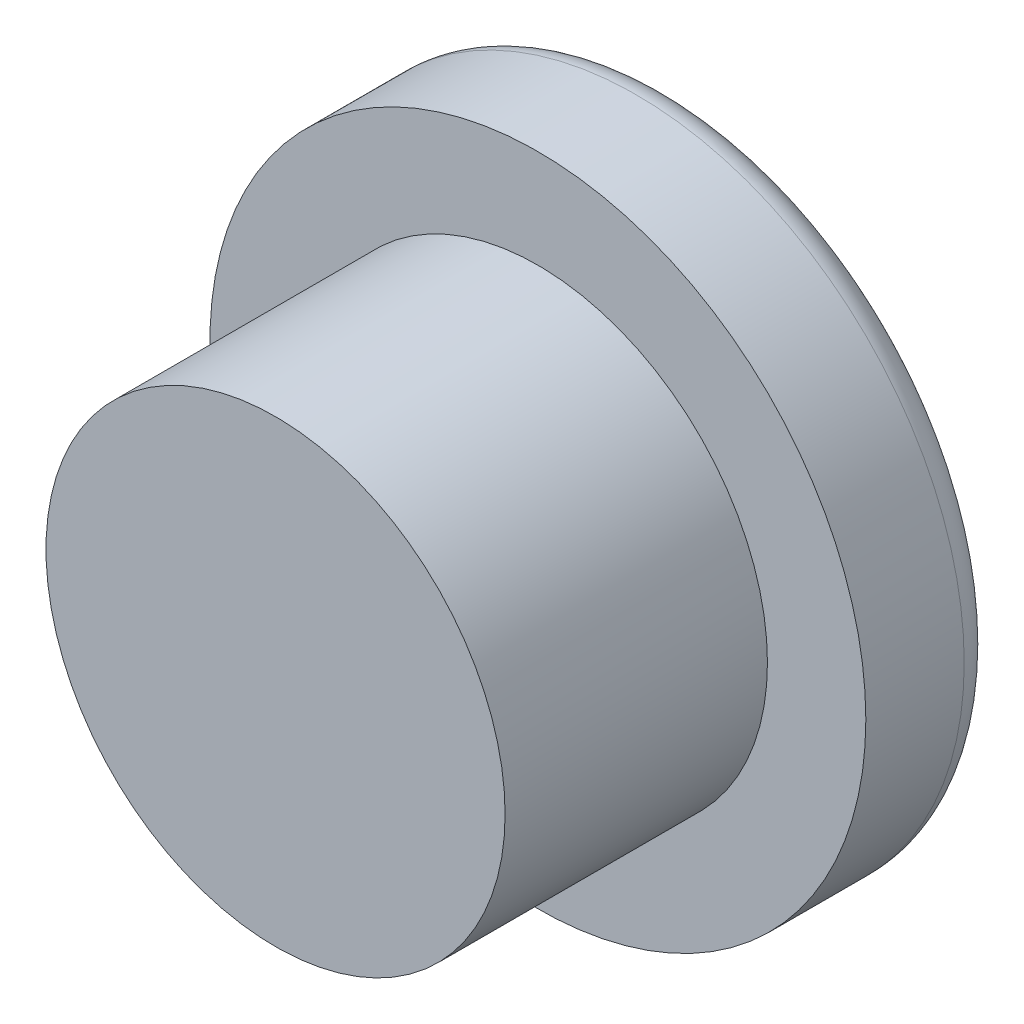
ISO-10303-21;
HEADER;
FILE_DESCRIPTION(('STEP AP214'),'2;1');
FILE_NAME('part.step','',(''),(''),'','','');
FILE_SCHEMA(('AUTOMOTIVE_DESIGN { 1 0 10303 214 1 1 1 1 }'));
ENDSEC;
DATA;
#1=APPLICATION_CONTEXT('core data for automotive mechanical design processes');
#2=APPLICATION_PROTOCOL_DEFINITION('international standard','automotive_design',2000,#1);
#3=PRODUCT_CONTEXT('',#1,'mechanical');
#4=PRODUCT('Part','Part','',(#3));
#5=PRODUCT_RELATED_PRODUCT_CATEGORY('part','',(#4));
#6=PRODUCT_DEFINITION_FORMATION('','',#4);
#7=PRODUCT_DEFINITION_CONTEXT('part definition',#1,'design');
#8=PRODUCT_DEFINITION('design','',#6,#7);
#9=PRODUCT_DEFINITION_SHAPE('','',#8);
#10=(LENGTH_UNIT() NAMED_UNIT(*) SI_UNIT(.MILLI.,.METRE.));
#11=(NAMED_UNIT(*) PLANE_ANGLE_UNIT() SI_UNIT($,.RADIAN.));
#12=(NAMED_UNIT(*) SI_UNIT($,.STERADIAN.) SOLID_ANGLE_UNIT());
#13=UNCERTAINTY_MEASURE_WITH_UNIT(LENGTH_MEASURE(1.E-05),#10,'distance_accuracy_value','');
#14=(GEOMETRIC_REPRESENTATION_CONTEXT(3) GLOBAL_UNCERTAINTY_ASSIGNED_CONTEXT((#13)) GLOBAL_UNIT_ASSIGNED_CONTEXT((#10,
#11,#12)) REPRESENTATION_CONTEXT('',''));
#15=CARTESIAN_POINT('',(0.,0.,0.));
#16=DIRECTION('',(0.,0.,1.));
#17=DIRECTION('',(1.,0.,0.));
#18=AXIS2_PLACEMENT_3D('',#15,#16,#17);
#19=CARTESIAN_POINT('',(0.,0.,0.2));
#20=DIRECTION('',(0.,0.,-1.));
#21=DIRECTION('',(-1.,0.,0.));
#22=AXIS2_PLACEMENT_3D('',#19,#20,#21);
#23=PLANE('',#22);
#24=DIRECTION('',(-0.327448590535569,-0.944868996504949,0.));
#25=VECTOR('',#24,1.);
#26=CARTESIAN_POINT('',(-1.08300194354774,1.94067828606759,0.2));
#27=LINE('',#26,#25);
#28=CARTESIAN_POINT('',(-1.08300194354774,1.94067828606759,0.2));
#29=VERTEX_POINT('',#28);
#30=CARTESIAN_POINT('',(-2.29594264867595,-1.55932171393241,0.2));
#31=VERTEX_POINT('',#30);
#32=EDGE_CURVE('E232',#29,#31,#27,.T.);
#33=ORIENTED_EDGE('',*,*,#32,.T.);
#34=DIRECTION('',(1.,0.,0.));
#35=VECTOR('',#34,1.);
#36=CARTESIAN_POINT('',(-2.29594264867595,-1.55932171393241,0.2));
#37=LINE('',#36,#35);
#38=CARTESIAN_POINT('',(-1.67404761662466,-1.55932171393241,0.2));
#39=VERTEX_POINT('',#38);
#40=EDGE_CURVE('E272',#31,#39,#37,.T.);
#41=ORIENTED_EDGE('',*,*,#40,.T.);
#42=DIRECTION('',(0.315486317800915,0.948930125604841,0.));
#43=VECTOR('',#42,1.);
#44=CARTESIAN_POINT('',(-1.67404761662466,-1.55932171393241,0.2));
#45=LINE('',#44,#43);
#46=CARTESIAN_POINT('',(-1.40551796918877,-0.751629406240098,0.2));
#47=VERTEX_POINT('',#46);
#48=EDGE_CURVE('E274',#39,#47,#45,.T.);
#49=ORIENTED_EDGE('',*,*,#48,.T.);
#50=DIRECTION('',(1.,0.,0.));
#51=VECTOR('',#50,1.);
#52=CARTESIAN_POINT('',(-1.40551796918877,-0.751629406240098,0.2));
#53=LINE('',#52,#51);
#54=CARTESIAN_POINT('',(-0.182060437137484,-0.751629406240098,0.2));
#55=VERTEX_POINT('',#54);
#56=EDGE_CURVE('E276',#47,#55,#53,.T.);
#57=ORIENTED_EDGE('',*,*,#56,.T.);
#58=DIRECTION('',(0.314001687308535,-0.949422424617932,0.));
#59=VECTOR('',#58,1.);
#60=CARTESIAN_POINT('',(-0.182060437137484,-0.751629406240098,0.2));
#61=LINE('',#60,#59);
#62=CARTESIAN_POINT('',(0.08506696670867,-1.55932171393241,0.2));
#63=VERTEX_POINT('',#62);
#64=EDGE_CURVE('E278',#55,#63,#61,.T.);
#65=ORIENTED_EDGE('',*,*,#64,.T.);
#66=DIRECTION('',(1.,0.,0.));
#67=VECTOR('',#66,1.);
#68=CARTESIAN_POINT('',(0.0850669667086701,-1.55932171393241,0.2));
#69=LINE('',#68,#67);
#70=CARTESIAN_POINT('',(0.710467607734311,-1.55932171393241,0.2));
#71=VERTEX_POINT('',#70);
#72=EDGE_CURVE('E280',#63,#71,#69,.T.);
#73=ORIENTED_EDGE('',*,*,#72,.T.);
#74=DIRECTION('',(-0.326095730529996,0.94533675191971,0.));
#75=VECTOR('',#74,1.);
#76=CARTESIAN_POINT('',(0.710467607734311,-1.55932171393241,0.2));
#77=LINE('',#76,#75);
#78=CARTESIAN_POINT('',(-0.496864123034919,1.94067828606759,0.2));
#79=VERTEX_POINT('',#78);
#80=EDGE_CURVE('E54',#71,#79,#77,.T.);
#81=ORIENTED_EDGE('',*,*,#80,.T.);
#82=DIRECTION('',(-1.,0.,0.));
#83=VECTOR('',#82,1.);
#84=CARTESIAN_POINT('',(-0.49686412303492,1.94067828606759,0.2));
#85=LINE('',#84,#83);
#86=EDGE_CURVE('E49',#79,#29,#85,.T.);
#87=ORIENTED_EDGE('',*,*,#86,.T.);
#88=EDGE_LOOP('',(#33,#41,#49,#57,#65,#73,#81,#87));
#89=FACE_BOUND('',#88,.T.);
#90=CARTESIAN_POINT('',(0.,0.,0.2));
#91=DIRECTION('',(0.,0.,-1.));
#92=DIRECTION('',(-1.,0.,0.));
#93=AXIS2_PLACEMENT_3D('',#90,#91,#92);
#94=CIRCLE('',#93,3.);
#95=CARTESIAN_POINT('',(-3.,0.,0.2));
#96=VERTEX_POINT('',#95);
#97=EDGE_CURVE('E371',#96,#96,#94,.T.);
#98=ORIENTED_EDGE('',*,*,#97,.T.);
#99=EDGE_LOOP('',(#98));
#100=FACE_BOUND('',#99,.T.);
#101=CARTESIAN_POINT('',(1.60888507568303,-1.6041935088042,0.2));
#102=CARTESIAN_POINT('',(1.64351677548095,-1.60346805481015,0.2));
#103=CARTESIAN_POINT('',(1.71141306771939,-1.60204578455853,0.2));
#104=CARTESIAN_POINT('',(1.81078883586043,-1.5884423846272,0.2));
#105=CARTESIAN_POINT('',(1.90511493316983,-1.56590722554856,0.2));
#106=CARTESIAN_POINT('',(1.99485388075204,-1.53520227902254,0.2));
#107=CARTESIAN_POINT('',(2.07928442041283,-1.49482879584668,0.2));
#108=CARTESIAN_POINT('',(2.15917672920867,-1.44629069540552,0.2));
#109=CARTESIAN_POINT('',(2.23386631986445,-1.38834020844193,0.2));
#110=CARTESIAN_POINT('',(2.30312372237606,-1.32157334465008,0.2));
#111=CARTESIAN_POINT('',(2.36656115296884,-1.24749298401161,0.2));
#112=CARTESIAN_POINT('',(2.42382412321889,-1.16714052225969,0.2));
#113=CARTESIAN_POINT('',(2.47364532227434,-1.0803084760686,0.2));
#114=CARTESIAN_POINT('',(2.51690191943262,-0.98755919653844,0.2));
#115=CARTESIAN_POINT('',(2.55463483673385,-0.889157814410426,0.2));
#116=CARTESIAN_POINT('',(2.58346916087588,-0.784036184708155,0.2));
#117=CARTESIAN_POINT('',(2.60691635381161,-0.673296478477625,0.2));
#118=CARTESIAN_POINT('',(2.61691221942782,-0.597000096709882,0.2));
#119=CARTESIAN_POINT('',(2.62200606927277,-0.558119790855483,0.2));
#120=B_SPLINE_CURVE_WITH_KNOTS('',3,(#101,#102,#103,#104,#105,#106,#107,#108,#109,#110,#111,
#112,#113,#114,#115,#116,#117,#118,#119),.UNSPECIFIED.,.F.,.F.,(4,1,1,1,1,1,1,1,1,1,1,1,1,1,1,1,
4),(0.,0.0643982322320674,0.126254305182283,0.186151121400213,0.244586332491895,
0.302344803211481,0.35990822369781,0.418173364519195,0.477826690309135,0.538564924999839,
0.599365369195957,0.66111133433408,0.72451567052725,0.789598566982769,0.85690310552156,
0.927078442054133,1.),.UNSPECIFIED.);
#121=CARTESIAN_POINT('',(1.60888507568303,-1.6041935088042,0.2));
#122=VERTEX_POINT('',#121);
#123=CARTESIAN_POINT('',(2.62200606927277,-0.558119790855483,0.2));
#124=VERTEX_POINT('',#123);
#125=EDGE_CURVE('E286',#122,#124,#120,.T.);
#126=ORIENTED_EDGE('',*,*,#125,.T.);
#127=DIRECTION('',(-0.990256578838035,0.139254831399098,0.));
#128=VECTOR('',#127,1.);
#129=CARTESIAN_POINT('',(2.62200606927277,-0.558119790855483,0.2));
#130=LINE('',#129,#128);
#131=CARTESIAN_POINT('',(2.08354453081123,-0.482398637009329,0.2));
#132=VERTEX_POINT('',#131);
#133=EDGE_CURVE('E491',#124,#132,#130,.T.);
#134=ORIENTED_EDGE('',*,*,#133,.T.);
#135=CARTESIAN_POINT('',(2.08354453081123,-0.482398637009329,0.2));
#136=CARTESIAN_POINT('',(2.07795153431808,-0.521916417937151,0.2));
#137=CARTESIAN_POINT('',(2.06722299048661,-0.597719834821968,0.2));
#138=CARTESIAN_POINT('',(2.03274186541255,-0.703447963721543,0.2));
#139=CARTESIAN_POINT('',(1.98674536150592,-0.797348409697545,0.2));
#140=CARTESIAN_POINT('',(1.92612479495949,-0.87617628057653,0.2));
#141=CARTESIAN_POINT('',(1.85748579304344,-0.940581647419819,0.2));
#142=CARTESIAN_POINT('',(1.78145311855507,-0.986451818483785,0.2));
#143=CARTESIAN_POINT('',(1.70048296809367,-1.01580040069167,0.2));
#144=CARTESIAN_POINT('',(1.64418256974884,-1.01916815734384,0.2));
#145=CARTESIAN_POINT('',(1.61589629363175,-1.02086017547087,0.2));
#146=B_SPLINE_CURVE_WITH_KNOTS('',3,(#135,#136,#137,#138,#139,#140,#141,#142,#143,#144,#145),
.UNSPECIFIED.,.F.,.F.,(4,1,1,1,1,1,1,1,4),(0.,0.15300386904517,0.293493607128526,
0.425139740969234,0.552582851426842,0.673264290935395,0.784390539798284,0.891674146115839,1.),.UNSPECIFIED.);
#147=CARTESIAN_POINT('',(1.61589629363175,-1.02086017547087,0.2));
#148=VERTEX_POINT('',#147);
#149=EDGE_CURVE('E484',#132,#148,#146,.T.);
#150=ORIENTED_EDGE('',*,*,#149,.T.);
#151=CARTESIAN_POINT('',(1.61589629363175,-1.02086017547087,0.2));
#152=CARTESIAN_POINT('',(1.58364962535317,-1.0192926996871,0.2));
#153=CARTESIAN_POINT('',(1.52064925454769,-1.01623031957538,0.2));
#154=CARTESIAN_POINT('',(1.43037815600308,-0.986474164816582,0.2));
#155=CARTESIAN_POINT('',(1.34856202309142,-0.9386279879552,0.2));
#156=CARTESIAN_POINT('',(1.28836205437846,-0.884018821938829,0.2));
#157=CARTESIAN_POINT('',(1.24589201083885,-0.831789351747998,0.2));
#158=CARTESIAN_POINT('',(1.21798648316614,-0.786636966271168,0.2));
#159=CARTESIAN_POINT('',(1.19398400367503,-0.737097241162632,0.2));
#160=CARTESIAN_POINT('',(1.17417322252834,-0.682900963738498,0.2));
#161=CARTESIAN_POINT('',(1.16003111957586,-0.623507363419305,0.2));
#162=CARTESIAN_POINT('',(1.14849542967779,-0.559904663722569,0.2));
#163=CARTESIAN_POINT('',(1.14240751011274,-0.491397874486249,0.2));
#164=CARTESIAN_POINT('',(1.14163552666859,-0.444314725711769,0.2));
#165=CARTESIAN_POINT('',(1.14123683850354,-0.41999879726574,0.2));
#166=B_SPLINE_CURVE_WITH_KNOTS('',3,(#151,#152,#153,#154,#155,#156,#157,#158,#159,#160,#161,
#162,#163,#164,#165),.UNSPECIFIED.,.F.,.F.,(4,1,1,1,1,1,1,1,1,1,1,1,4),(0.,0.111915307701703,
0.218649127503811,0.326887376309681,0.439744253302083,0.499311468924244,0.56068871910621,
0.623975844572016,0.690607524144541,0.761022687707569,0.836163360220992,0.915387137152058,1.),.UNSPECIFIED.);
#167=CARTESIAN_POINT('',(1.14123683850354,-0.41999879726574,0.2));
#168=VERTEX_POINT('',#167);
#169=EDGE_CURVE('E477',#148,#168,#166,.T.);
#170=ORIENTED_EDGE('',*,*,#169,.T.);
#171=CARTESIAN_POINT('',(1.14123683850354,-0.41999879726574,0.2));
#172=CARTESIAN_POINT('',(1.14169931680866,-0.397088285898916,0.2));
#173=CARTESIAN_POINT('',(1.14259269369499,-0.35283167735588,0.2));
#174=CARTESIAN_POINT('',(1.14778220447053,-0.288523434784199,0.2));
#175=CARTESIAN_POINT('',(1.15857566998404,-0.228839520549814,0.2));
#176=CARTESIAN_POINT('',(1.17258291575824,-0.173318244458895,0.2));
#177=CARTESIAN_POINT('',(1.18949544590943,-0.121655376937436,0.2));
#178=CARTESIAN_POINT('',(1.21255043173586,-0.0753181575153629,0.2));
#179=CARTESIAN_POINT('',(1.23809985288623,-0.0327084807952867,0.2));
#180=CARTESIAN_POINT('',(1.27841266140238,0.0161788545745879,0.2));
#181=CARTESIAN_POINT('',(1.33591459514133,0.0683306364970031,0.2));
#182=CARTESIAN_POINT('',(1.41635277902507,0.11419911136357,0.2));
#183=CARTESIAN_POINT('',(1.50747128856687,0.140703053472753,0.2));
#184=CARTESIAN_POINT('',(1.57108476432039,0.144067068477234,0.2));
#185=CARTESIAN_POINT('',(1.60397722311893,0.145806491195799,0.2));
#186=B_SPLINE_CURVE_WITH_KNOTS('',3,(#171,#172,#173,#174,#175,#176,#177,#178,#179,#180,#181,
#182,#183,#184,#185),.UNSPECIFIED.,.F.,.F.,(4,1,1,1,1,1,1,1,1,1,1,1,4),(0.,0.0830930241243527,
0.160512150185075,0.233661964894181,0.302725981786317,0.368120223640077,0.430282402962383,
0.490023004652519,0.54786387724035,0.659488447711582,0.769548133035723,0.880840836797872,1.),.UNSPECIFIED.);
#187=CARTESIAN_POINT('',(1.60397722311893,0.145806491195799,0.2));
#188=VERTEX_POINT('',#187);
#189=EDGE_CURVE('E470',#168,#188,#186,.T.);
#190=ORIENTED_EDGE('',*,*,#189,.T.);
#191=CARTESIAN_POINT('',(1.60397722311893,0.145806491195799,0.2));
#192=CARTESIAN_POINT('',(1.62507558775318,0.145007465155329,0.2));
#193=CARTESIAN_POINT('',(1.6671839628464,0.143412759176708,0.2));
#194=CARTESIAN_POINT('',(1.72943262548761,0.13015581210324,0.2));
#195=CARTESIAN_POINT('',(1.7900791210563,0.109157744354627,0.2));
#196=CARTESIAN_POINT('',(1.84879190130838,0.0790851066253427,0.2));
#197=CARTESIAN_POINT('',(1.90581243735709,0.0410768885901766,0.2));
#198=CARTESIAN_POINT('',(1.96064040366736,-0.00591514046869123,0.2));
#199=CARTESIAN_POINT('',(2.01424118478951,-0.0607660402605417,0.2));
#200=CARTESIAN_POINT('',(2.04698719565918,-0.102073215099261,0.2));
#201=CARTESIAN_POINT('',(2.06391312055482,-0.12342427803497,0.2));
#202=B_SPLINE_CURVE_WITH_KNOTS('',3,(#191,#192,#193,#194,#195,#196,#197,#198,#199,#200,#201),
.UNSPECIFIED.,.F.,.F.,(4,1,1,1,1,1,1,1,4),(0.,0.11431126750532,0.228143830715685,
0.343573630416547,0.461460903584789,0.584833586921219,0.714322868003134,0.852337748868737,1.),.UNSPECIFIED.);
#203=CARTESIAN_POINT('',(2.06391312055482,-0.12342427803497,0.2));
#204=VERTEX_POINT('',#203);
#205=EDGE_CURVE('E466',#188,#204,#202,.T.);
#206=ORIENTED_EDGE('',*,*,#205,.T.);
#207=DIRECTION('',(0.987254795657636,0.159147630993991,0.));
#208=VECTOR('',#207,1.);
#209=CARTESIAN_POINT('',(2.06391312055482,-0.12342427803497,0.2));
#210=LINE('',#209,#208);
#211=CARTESIAN_POINT('',(2.57713427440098,-0.0406919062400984,0.2));
#212=VERTEX_POINT('',#211);
#213=EDGE_CURVE('E464',#204,#212,#210,.T.);
#214=ORIENTED_EDGE('',*,*,#213,.T.);
#215=DIRECTION('',(-0.182267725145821,0.983248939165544,0.));
#216=VECTOR('',#215,1.);
#217=CARTESIAN_POINT('',(2.57713427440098,-0.0406919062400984,0.2));
#218=LINE('',#217,#216);
#219=CARTESIAN_POINT('',(2.21815991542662,1.8958064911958,0.2));
#220=VERTEX_POINT('',#219);
#221=EDGE_CURVE('E462',#212,#220,#218,.T.);
#222=ORIENTED_EDGE('',*,*,#221,.T.);
#223=DIRECTION('',(-1.,0.,0.));
#224=VECTOR('',#223,1.);
#225=CARTESIAN_POINT('',(2.21815991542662,1.8958064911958,0.2));
#226=LINE('',#225,#224);
#227=CARTESIAN_POINT('',(0.692518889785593,1.8958064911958,0.2));
#228=VERTEX_POINT('',#227);
#229=EDGE_CURVE('E460',#220,#228,#226,.T.);
#230=ORIENTED_EDGE('',*,*,#229,.T.);
#231=DIRECTION('',(0.,-1.,0.));
#232=VECTOR('',#231,1.);
#233=CARTESIAN_POINT('',(0.692518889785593,1.8958064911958,0.2));
#234=LINE('',#233,#232);
#235=CARTESIAN_POINT('',(0.692518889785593,1.22272956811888,0.2));
#236=VERTEX_POINT('',#235);
#237=EDGE_CURVE('E458',#228,#236,#234,.T.);
#238=ORIENTED_EDGE('',*,*,#237,.T.);
#239=DIRECTION('',(1.,0.,0.));
#240=VECTOR('',#239,1.);
#241=CARTESIAN_POINT('',(0.692518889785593,1.22272956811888,0.2));
#242=LINE('',#241,#240);
#243=CARTESIAN_POINT('',(1.75261504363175,1.22272956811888,0.2));
#244=VERTEX_POINT('',#243);
#245=EDGE_CURVE('E456',#236,#244,#242,.T.);
#246=ORIENTED_EDGE('',*,*,#245,.T.);
#247=DIRECTION('',(0.190541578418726,-0.98167912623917,0.));
#248=VECTOR('',#247,1.);
#249=CARTESIAN_POINT('',(1.75261504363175,1.22272956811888,0.2));
#250=LINE('',#249,#248);
#251=CARTESIAN_POINT('',(1.87250687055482,0.605041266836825,0.2));
#252=VERTEX_POINT('',#251);
#253=EDGE_CURVE('E451',#244,#252,#250,.T.);
#254=ORIENTED_EDGE('',*,*,#253,.T.);
#255=CARTESIAN_POINT('',(1.87250687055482,0.605041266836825,0.2));
#256=CARTESIAN_POINT('',(1.84046062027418,0.623898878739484,0.2));
#257=CARTESIAN_POINT('',(1.77800527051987,0.660650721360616,0.2));
#258=CARTESIAN_POINT('',(1.67900329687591,0.700170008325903,0.2));
#259=CARTESIAN_POINT('',(1.57876132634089,0.724650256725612,0.2));
#260=CARTESIAN_POINT('',(1.51132908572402,0.727648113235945,0.2));
#261=CARTESIAN_POINT('',(1.477775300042,0.729139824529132,0.2));
#262=B_SPLINE_CURVE_WITH_KNOTS('',3,(#255,#256,#257,#258,#259,#260,#261),.UNSPECIFIED.,.F.,.F.,
(4,1,1,1,4),(0.,0.265758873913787,0.517940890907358,0.760130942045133,1.),.UNSPECIFIED.);
#263=CARTESIAN_POINT('',(1.477775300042,0.729139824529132,0.2));
#264=VERTEX_POINT('',#263);
#265=EDGE_CURVE('E444',#252,#264,#262,.T.);
#266=ORIENTED_EDGE('',*,*,#265,.T.);
#267=CARTESIAN_POINT('',(1.477775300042,0.729139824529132,0.2));
#268=CARTESIAN_POINT('',(1.446165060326,0.728236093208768,0.2));
#269=CARTESIAN_POINT('',(1.38399292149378,0.726458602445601,0.2));
#270=CARTESIAN_POINT('',(1.29272184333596,0.711204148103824,0.2));
#271=CARTESIAN_POINT('',(1.20522688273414,0.686620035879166,0.2));
#272=CARTESIAN_POINT('',(1.12101987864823,0.652147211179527,0.2));
#273=CARTESIAN_POINT('',(1.04117106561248,0.606808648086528,0.2));
#274=CARTESIAN_POINT('',(0.964479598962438,0.552424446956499,0.2));
#275=CARTESIAN_POINT('',(0.892555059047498,0.487309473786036,0.2));
#276=CARTESIAN_POINT('',(0.823918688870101,0.413978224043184,0.2));
#277=CARTESIAN_POINT('',(0.761166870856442,0.332830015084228,0.2));
#278=CARTESIAN_POINT('',(0.707167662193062,0.244329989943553,0.2));
#279=CARTESIAN_POINT('',(0.660450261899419,0.150687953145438,0.2));
#280=CARTESIAN_POINT('',(0.622519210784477,0.0509084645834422,0.2));
#281=CARTESIAN_POINT('',(0.594059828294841,-0.0551462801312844,0.2));
#282=CARTESIAN_POINT('',(0.573045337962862,-0.166684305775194,0.2));
#283=CARTESIAN_POINT('',(0.560201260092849,-0.2841489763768,0.2));
#284=CARTESIAN_POINT('',(0.558679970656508,-0.364343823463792,0.2));
#285=CARTESIAN_POINT('',(0.557903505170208,-0.405275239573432,0.2));
#286=B_SPLINE_CURVE_WITH_KNOTS('',3,(#267,#268,#269,#270,#271,#272,#273,#274,#275,#276,#277,
#278,#279,#280,#281,#282,#283,#284,#285),.UNSPECIFIED.,.F.,.F.,(4,1,1,1,1,1,1,1,1,1,1,1,1,1,1,1,
4),(0.,0.0581744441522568,0.114419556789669,0.169867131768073,0.225249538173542,
0.281511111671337,0.338591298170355,0.398023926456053,0.459833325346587,0.523356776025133,
0.586536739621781,0.650432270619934,0.715810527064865,0.782730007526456,0.852361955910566,
0.924645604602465,1.),.UNSPECIFIED.);
#287=CARTESIAN_POINT('',(0.557903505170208,-0.405275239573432,0.2));
#288=VERTEX_POINT('',#287);
#289=EDGE_CURVE('E437',#264,#288,#286,.T.);
#290=ORIENTED_EDGE('',*,*,#289,.T.);
#291=CARTESIAN_POINT('',(0.557903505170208,-0.405275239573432,0.2));
#292=CARTESIAN_POINT('',(0.558556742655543,-0.439658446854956,0.2));
#293=CARTESIAN_POINT('',(0.559852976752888,-0.507885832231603,0.2));
#294=CARTESIAN_POINT('',(0.570804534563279,-0.608592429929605,0.2));
#295=CARTESIAN_POINT('',(0.587549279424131,-0.706783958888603,0.2));
#296=CARTESIAN_POINT('',(0.610985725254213,-0.802183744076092,0.2));
#297=CARTESIAN_POINT('',(0.643257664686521,-0.894412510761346,0.2));
#298=CARTESIAN_POINT('',(0.680878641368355,-0.984010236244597,0.2));
#299=CARTESIAN_POINT('',(0.725071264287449,-1.07133868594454,0.2));
#300=CARTESIAN_POINT('',(0.760277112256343,-1.12631219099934,0.2));
#301=CARTESIAN_POINT('',(0.778055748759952,-1.15407331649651,0.2));
#302=B_SPLINE_CURVE_WITH_KNOTS('',3,(#291,#292,#293,#294,#295,#296,#297,#298,#299,#300,#301),
.UNSPECIFIED.,.F.,.F.,(4,1,1,1,1,1,1,1,4),(0.,0.130195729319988,0.258350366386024,
0.38321002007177,0.507298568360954,0.629907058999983,0.752879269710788,0.875206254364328,1.),.UNSPECIFIED.);
#303=CARTESIAN_POINT('',(0.778055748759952,-1.15407331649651,0.2));
#304=VERTEX_POINT('',#303);
#305=EDGE_CURVE('E430',#288,#304,#302,.T.);
#306=ORIENTED_EDGE('',*,*,#305,.T.);
#307=CARTESIAN_POINT('',(0.778055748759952,-1.15407331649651,0.2));
#308=CARTESIAN_POINT('',(0.803460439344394,-1.18973650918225,0.2));
#309=CARTESIAN_POINT('',(0.853158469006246,-1.25950277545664,0.2));
#310=CARTESIAN_POINT('',(0.939171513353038,-1.3517628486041,0.2));
#311=CARTESIAN_POINT('',(1.03250154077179,-1.4300463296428,0.2));
#312=CARTESIAN_POINT('',(1.13386475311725,-1.49356439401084,0.2));
#313=CARTESIAN_POINT('',(1.24211111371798,-1.54378777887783,0.2));
#314=CARTESIAN_POINT('',(1.35798296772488,-1.57884719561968,0.2));
#315=CARTESIAN_POINT('',(1.48093933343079,-1.60043858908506,0.2));
#316=CARTESIAN_POINT('',(1.565558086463,-1.60292195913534,0.2));
#317=CARTESIAN_POINT('',(1.60888507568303,-1.6041935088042,0.2));
#318=B_SPLINE_CURVE_WITH_KNOTS('',3,(#307,#308,#309,#310,#311,#312,#313,#314,#315,#316,#317),
.UNSPECIFIED.,.F.,.F.,(4,1,1,1,1,1,1,1,4),(0.,0.132868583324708,0.25992470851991,
0.381880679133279,0.501806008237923,0.622167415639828,0.743179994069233,0.868501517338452,1.),.UNSPECIFIED.);
#319=EDGE_CURVE('E313',#304,#122,#318,.T.);
#320=ORIENTED_EDGE('',*,*,#319,.T.);
#321=EDGE_LOOP('',(#126,#134,#150,#170,#190,#206,#214,#222,#230,#238,#246,#254,#266,#290,#306,#320));
#322=FACE_BOUND('',#321,.T.);
#323=ADVANCED_FACE('F34',(#89,#100,#322),#23,.T.);
#324=CARTESIAN_POINT('',(0.,0.,6.));
#325=DIRECTION('',(0.,0.,-1.));
#326=DIRECTION('',(-1.,0.,0.));
#327=AXIS2_PLACEMENT_3D('',#324,#325,#326);
#328=CYLINDRICAL_SURFACE('',#327,5.);
#329=CARTESIAN_POINT('',(0.,0.,0.5));
#330=DIRECTION('',(0.,0.,1.));
#331=DIRECTION('',(1.,0.,0.));
#332=AXIS2_PLACEMENT_3D('',#329,#330,#331);
#333=CIRCLE('',#332,5.);
#334=CARTESIAN_POINT('',(5.,0.,0.5));
#335=VERTEX_POINT('',#334);
#336=EDGE_CURVE('E42',#335,#335,#333,.T.);
#337=ORIENTED_EDGE('',*,*,#336,.T.);
#338=EDGE_LOOP('',(#337));
#339=FACE_BOUND('',#338,.T.);
#340=CARTESIAN_POINT('',(0.,0.,2.));
#341=DIRECTION('',(0.,0.,1.));
#342=DIRECTION('',(1.,0.,0.));
#343=AXIS2_PLACEMENT_3D('',#340,#341,#342);
#344=CIRCLE('',#343,5.);
#345=CARTESIAN_POINT('',(5.,0.,2.));
#346=VERTEX_POINT('',#345);
#347=EDGE_CURVE('E362',#346,#346,#344,.T.);
#348=ORIENTED_EDGE('',*,*,#347,.F.);
#349=EDGE_LOOP('',(#348));
#350=FACE_BOUND('',#349,.T.);
#351=ADVANCED_FACE('F350',(#339,#350),#328,.T.);
#352=CARTESIAN_POINT('',(0.,0.,0.));
#353=DIRECTION('',(0.,0.,1.));
#354=DIRECTION('',(1.,0.,0.));
#355=AXIS2_PLACEMENT_3D('',#352,#353,#354);
#356=PLANE('',#355);
#357=CARTESIAN_POINT('',(0.,0.,0.));
#358=DIRECTION('',(0.,0.,1.));
#359=DIRECTION('',(1.,0.,0.));
#360=AXIS2_PLACEMENT_3D('',#357,#358,#359);
#361=CIRCLE('',#360,4.5);
#362=CARTESIAN_POINT('',(4.5,0.,0.));
#363=VERTEX_POINT('',#362);
#364=EDGE_CURVE('E12',#363,#363,#361,.F.);
#365=ORIENTED_EDGE('',*,*,#364,.T.);
#366=EDGE_LOOP('',(#365));
#367=FACE_BOUND('',#366,.T.);
#368=CARTESIAN_POINT('',(0.,0.,0.));
#369=DIRECTION('',(0.,0.,-1.));
#370=DIRECTION('',(-1.,0.,0.));
#371=AXIS2_PLACEMENT_3D('',#368,#369,#370);
#372=CIRCLE('',#371,3.);
#373=CARTESIAN_POINT('',(-3.,0.,0.));
#374=VERTEX_POINT('',#373);
#375=EDGE_CURVE('E373',#374,#374,#372,.T.);
#376=ORIENTED_EDGE('',*,*,#375,.F.);
#377=EDGE_LOOP('',(#376));
#378=FACE_BOUND('',#377,.T.);
#379=ADVANCED_FACE('F344',(#367,#378),#356,.F.);
#380=CARTESIAN_POINT('',(0.,0.,2.));
#381=DIRECTION('',(0.,0.,1.));
#382=DIRECTION('',(1.,0.,0.));
#383=AXIS2_PLACEMENT_3D('',#380,#381,#382);
#384=PLANE('',#383);
#385=CARTESIAN_POINT('',(0.,0.,2.));
#386=DIRECTION('',(0.,0.,1.));
#387=DIRECTION('',(1.,0.,0.));
#388=AXIS2_PLACEMENT_3D('',#385,#386,#387);
#389=CIRCLE('',#388,3.5);
#390=CARTESIAN_POINT('',(3.5,0.,2.));
#391=VERTEX_POINT('',#390);
#392=EDGE_CURVE('E364',#391,#391,#389,.T.);
#393=ORIENTED_EDGE('',*,*,#392,.F.);
#394=EDGE_LOOP('',(#393));
#395=FACE_BOUND('',#394,.T.);
#396=ORIENTED_EDGE('',*,*,#347,.T.);
#397=EDGE_LOOP('',(#396));
#398=FACE_BOUND('',#397,.T.);
#399=ADVANCED_FACE('F340',(#395,#398),#384,.T.);
#400=CARTESIAN_POINT('',(0.,0.,2.));
#401=DIRECTION('',(0.,0.,1.));
#402=DIRECTION('',(1.,0.,0.));
#403=AXIS2_PLACEMENT_3D('',#400,#401,#402);
#404=CYLINDRICAL_SURFACE('',#403,3.5);
#405=ORIENTED_EDGE('',*,*,#392,.T.);
#406=EDGE_LOOP('',(#405));
#407=FACE_BOUND('',#406,.T.);
#408=CARTESIAN_POINT('',(0.,0.,6.));
#409=DIRECTION('',(0.,0.,1.));
#410=DIRECTION('',(1.,0.,0.));
#411=AXIS2_PLACEMENT_3D('',#408,#409,#410);
#412=CIRCLE('',#411,3.5);
#413=CARTESIAN_POINT('',(3.5,0.,6.));
#414=VERTEX_POINT('',#413);
#415=EDGE_CURVE('E367',#414,#414,#412,.T.);
#416=ORIENTED_EDGE('',*,*,#415,.F.);
#417=EDGE_LOOP('',(#416));
#418=FACE_BOUND('',#417,.T.);
#419=ADVANCED_FACE('F337',(#407,#418),#404,.T.);
#420=CARTESIAN_POINT('',(0.,0.,6.));
#421=DIRECTION('',(0.,0.,1.));
#422=DIRECTION('',(1.,0.,0.));
#423=AXIS2_PLACEMENT_3D('',#420,#421,#422);
#424=PLANE('',#423);
#425=ORIENTED_EDGE('',*,*,#415,.T.);
#426=EDGE_LOOP('',(#425));
#427=FACE_BOUND('',#426,.T.);
#428=ADVANCED_FACE('F335',(#427),#424,.T.);
#429=CARTESIAN_POINT('',(0.,0.,0.2));
#430=DIRECTION('',(0.,0.,-1.));
#431=DIRECTION('',(-1.,0.,0.));
#432=AXIS2_PLACEMENT_3D('',#429,#430,#431);
#433=CYLINDRICAL_SURFACE('',#432,3.);
#434=ORIENTED_EDGE('',*,*,#97,.F.);
#435=EDGE_LOOP('',(#434));
#436=FACE_BOUND('',#435,.T.);
#437=ORIENTED_EDGE('',*,*,#375,.T.);
#438=EDGE_LOOP('',(#437));
#439=FACE_BOUND('',#438,.T.);
#440=ADVANCED_FACE('F332',(#436,#439),#433,.F.);
#441=CARTESIAN_POINT('',(0.,0.,0.5));
#442=DIRECTION('',(0.,0.,1.));
#443=DIRECTION('',(1.,0.,0.));
#444=AXIS2_PLACEMENT_3D('',#441,#442,#443);
#445=TOROIDAL_SURFACE('',#444,4.5,0.5);
#446=ORIENTED_EDGE('',*,*,#364,.F.);
#447=EDGE_LOOP('',(#446));
#448=FACE_BOUND('',#447,.T.);
#449=ORIENTED_EDGE('',*,*,#336,.F.);
#450=EDGE_LOOP('',(#449));
#451=FACE_BOUND('',#450,.T.);
#452=ADVANCED_FACE('F36',(#448,#451),#445,.T.);
#453=CARTESIAN_POINT('',(1.60888507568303,-1.6041935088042,0.));
#454=CARTESIAN_POINT('',(1.64351677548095,-1.60346805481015,0.));
#455=CARTESIAN_POINT('',(1.71141306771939,-1.60204578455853,0.));
#456=CARTESIAN_POINT('',(1.81078883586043,-1.5884423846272,0.));
#457=CARTESIAN_POINT('',(1.90511493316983,-1.56590722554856,0.));
#458=CARTESIAN_POINT('',(1.99485388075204,-1.53520227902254,0.));
#459=CARTESIAN_POINT('',(2.07928442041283,-1.49482879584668,0.));
#460=CARTESIAN_POINT('',(2.15917672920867,-1.44629069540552,0.));
#461=CARTESIAN_POINT('',(2.23386631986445,-1.38834020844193,0.));
#462=CARTESIAN_POINT('',(2.30312372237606,-1.32157334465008,0.));
#463=CARTESIAN_POINT('',(2.36656115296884,-1.24749298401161,0.));
#464=CARTESIAN_POINT('',(2.42382412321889,-1.16714052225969,0.));
#465=CARTESIAN_POINT('',(2.47364532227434,-1.0803084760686,0.));
#466=CARTESIAN_POINT('',(2.51690191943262,-0.98755919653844,0.));
#467=CARTESIAN_POINT('',(2.55463483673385,-0.889157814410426,0.));
#468=CARTESIAN_POINT('',(2.58346916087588,-0.784036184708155,0.));
#469=CARTESIAN_POINT('',(2.60691635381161,-0.673296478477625,0.));
#470=CARTESIAN_POINT('',(2.61691221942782,-0.597000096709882,0.));
#471=CARTESIAN_POINT('',(2.62200606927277,-0.558119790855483,0.));
#472=B_SPLINE_CURVE_WITH_KNOTS('',3,(#453,#454,#455,#456,#457,#458,#459,#460,#461,#462,#463,
#464,#465,#466,#467,#468,#469,#470,#471),.UNSPECIFIED.,.F.,.F.,(4,1,1,1,1,1,1,1,1,1,1,1,1,1,1,1,
4),(0.,0.0643982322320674,0.126254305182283,0.186151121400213,0.244586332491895,
0.302344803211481,0.35990822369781,0.418173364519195,0.477826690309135,0.538564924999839,
0.599365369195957,0.66111133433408,0.72451567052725,0.789598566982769,0.85690310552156,
0.927078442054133,1.),.UNSPECIFIED.);
#473=DIRECTION('',(0.,0.,1.));
#474=VECTOR('',#473,1.);
#475=SURFACE_OF_LINEAR_EXTRUSION('',#472,#474);
#476=ORIENTED_EDGE('',*,*,#125,.F.);
#477=DIRECTION('',(0.,0.,1.));
#478=VECTOR('',#477,1.);
#479=CARTESIAN_POINT('',(1.60888507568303,-1.6041935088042,0.));
#480=LINE('',#479,#478);
#481=CARTESIAN_POINT('',(1.60888507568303,-1.6041935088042,0.));
#482=VERTEX_POINT('',#481);
#483=EDGE_CURVE('E376',#482,#122,#480,.T.);
#484=ORIENTED_EDGE('',*,*,#483,.F.);
#485=CARTESIAN_POINT('',(2.62200606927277,-0.558119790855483,0.));
#486=VERTEX_POINT('',#485);
#487=EDGE_CURVE('E306',#482,#486,#472,.T.);
#488=ORIENTED_EDGE('',*,*,#487,.T.);
#489=DIRECTION('',(0.,0.,1.));
#490=VECTOR('',#489,1.);
#491=CARTESIAN_POINT('',(2.62200606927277,-0.558119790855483,0.));
#492=LINE('',#491,#490);
#493=EDGE_CURVE('E379',#486,#124,#492,.T.);
#494=ORIENTED_EDGE('',*,*,#493,.T.);
#495=EDGE_LOOP('',(#476,#484,#488,#494));
#496=FACE_BOUND('',#495,.T.);
#497=ADVANCED_FACE('F319',(#496),#475,.T.);
#498=CARTESIAN_POINT('',(0.778055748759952,-1.15407331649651,0.));
#499=CARTESIAN_POINT('',(0.803460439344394,-1.18973650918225,0.));
#500=CARTESIAN_POINT('',(0.853158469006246,-1.25950277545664,0.));
#501=CARTESIAN_POINT('',(0.939171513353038,-1.3517628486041,0.));
#502=CARTESIAN_POINT('',(1.03250154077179,-1.4300463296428,0.));
#503=CARTESIAN_POINT('',(1.13386475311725,-1.49356439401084,0.));
#504=CARTESIAN_POINT('',(1.24211111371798,-1.54378777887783,0.));
#505=CARTESIAN_POINT('',(1.35798296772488,-1.57884719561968,0.));
#506=CARTESIAN_POINT('',(1.48093933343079,-1.60043858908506,0.));
#507=CARTESIAN_POINT('',(1.565558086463,-1.60292195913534,0.));
#508=CARTESIAN_POINT('',(1.60888507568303,-1.6041935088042,0.));
#509=B_SPLINE_CURVE_WITH_KNOTS('',3,(#498,#499,#500,#501,#502,#503,#504,#505,#506,#507,#508),
.UNSPECIFIED.,.F.,.F.,(4,1,1,1,1,1,1,1,4),(0.,0.132868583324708,0.25992470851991,
0.381880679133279,0.501806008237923,0.622167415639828,0.743179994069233,0.868501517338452,1.),.UNSPECIFIED.);
#510=DIRECTION('',(0.,0.,1.));
#511=VECTOR('',#510,1.);
#512=SURFACE_OF_LINEAR_EXTRUSION('',#509,#511);
#513=ORIENTED_EDGE('',*,*,#319,.F.);
#514=DIRECTION('',(0.,0.,1.));
#515=VECTOR('',#514,1.);
#516=CARTESIAN_POINT('',(0.778055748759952,-1.15407331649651,0.));
#517=LINE('',#516,#515);
#518=CARTESIAN_POINT('',(0.778055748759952,-1.15407331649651,0.));
#519=VERTEX_POINT('',#518);
#520=EDGE_CURVE('E422',#519,#304,#517,.T.);
#521=ORIENTED_EDGE('',*,*,#520,.F.);
#522=EDGE_CURVE('E383',#519,#482,#509,.T.);
#523=ORIENTED_EDGE('',*,*,#522,.T.);
#524=ORIENTED_EDGE('',*,*,#483,.T.);
#525=EDGE_LOOP('',(#513,#521,#523,#524));
#526=FACE_BOUND('',#525,.T.);
#527=ADVANCED_FACE('F323',(#526),#512,.T.);
#528=CARTESIAN_POINT('',(0.557903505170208,-0.405275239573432,0.));
#529=CARTESIAN_POINT('',(0.558556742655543,-0.439658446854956,0.));
#530=CARTESIAN_POINT('',(0.559852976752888,-0.507885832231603,0.));
#531=CARTESIAN_POINT('',(0.570804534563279,-0.608592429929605,0.));
#532=CARTESIAN_POINT('',(0.587549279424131,-0.706783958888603,0.));
#533=CARTESIAN_POINT('',(0.610985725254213,-0.802183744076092,0.));
#534=CARTESIAN_POINT('',(0.643257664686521,-0.894412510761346,0.));
#535=CARTESIAN_POINT('',(0.680878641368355,-0.984010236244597,0.));
#536=CARTESIAN_POINT('',(0.725071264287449,-1.07133868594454,0.));
#537=CARTESIAN_POINT('',(0.760277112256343,-1.12631219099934,0.));
#538=CARTESIAN_POINT('',(0.778055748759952,-1.15407331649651,0.));
#539=B_SPLINE_CURVE_WITH_KNOTS('',3,(#528,#529,#530,#531,#532,#533,#534,#535,#536,#537,#538),
.UNSPECIFIED.,.F.,.F.,(4,1,1,1,1,1,1,1,4),(0.,0.130195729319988,0.258350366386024,
0.38321002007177,0.507298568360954,0.629907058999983,0.752879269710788,0.875206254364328,1.),.UNSPECIFIED.);
#540=DIRECTION('',(0.,0.,1.));
#541=VECTOR('',#540,1.);
#542=SURFACE_OF_LINEAR_EXTRUSION('',#539,#541);
#543=ORIENTED_EDGE('',*,*,#305,.F.);
#544=DIRECTION('',(0.,0.,1.));
#545=VECTOR('',#544,1.);
#546=CARTESIAN_POINT('',(0.557903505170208,-0.405275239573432,0.));
#547=LINE('',#546,#545);
#548=CARTESIAN_POINT('',(0.557903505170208,-0.405275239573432,0.));
#549=VERTEX_POINT('',#548);
#550=EDGE_CURVE('E419',#549,#288,#547,.T.);
#551=ORIENTED_EDGE('',*,*,#550,.F.);
#552=EDGE_CURVE('E507',#549,#519,#539,.T.);
#553=ORIENTED_EDGE('',*,*,#552,.T.);
#554=ORIENTED_EDGE('',*,*,#520,.T.);
#555=EDGE_LOOP('',(#543,#551,#553,#554));
#556=FACE_BOUND('',#555,.T.);
#557=ADVANCED_FACE('F519',(#556),#542,.T.);
#558=CARTESIAN_POINT('',(1.477775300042,0.729139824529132,0.));
#559=CARTESIAN_POINT('',(1.446165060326,0.728236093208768,0.));
#560=CARTESIAN_POINT('',(1.38399292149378,0.726458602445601,0.));
#561=CARTESIAN_POINT('',(1.29272184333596,0.711204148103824,0.));
#562=CARTESIAN_POINT('',(1.20522688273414,0.686620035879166,0.));
#563=CARTESIAN_POINT('',(1.12101987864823,0.652147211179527,0.));
#564=CARTESIAN_POINT('',(1.04117106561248,0.606808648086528,0.));
#565=CARTESIAN_POINT('',(0.964479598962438,0.552424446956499,0.));
#566=CARTESIAN_POINT('',(0.892555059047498,0.487309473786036,0.));
#567=CARTESIAN_POINT('',(0.823918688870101,0.413978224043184,0.));
#568=CARTESIAN_POINT('',(0.761166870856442,0.332830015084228,0.));
#569=CARTESIAN_POINT('',(0.707167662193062,0.244329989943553,0.));
#570=CARTESIAN_POINT('',(0.660450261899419,0.150687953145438,0.));
#571=CARTESIAN_POINT('',(0.622519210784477,0.0509084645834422,0.));
#572=CARTESIAN_POINT('',(0.594059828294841,-0.0551462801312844,0.));
#573=CARTESIAN_POINT('',(0.573045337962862,-0.166684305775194,0.));
#574=CARTESIAN_POINT('',(0.560201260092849,-0.2841489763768,0.));
#575=CARTESIAN_POINT('',(0.558679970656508,-0.364343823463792,0.));
#576=CARTESIAN_POINT('',(0.557903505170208,-0.405275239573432,0.));
#577=B_SPLINE_CURVE_WITH_KNOTS('',3,(#558,#559,#560,#561,#562,#563,#564,#565,#566,#567,#568,
#569,#570,#571,#572,#573,#574,#575,#576),.UNSPECIFIED.,.F.,.F.,(4,1,1,1,1,1,1,1,1,1,1,1,1,1,1,1,
4),(0.,0.0581744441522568,0.114419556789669,0.169867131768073,0.225249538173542,
0.281511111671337,0.338591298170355,0.398023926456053,0.459833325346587,0.523356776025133,
0.586536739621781,0.650432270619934,0.715810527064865,0.782730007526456,0.852361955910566,
0.924645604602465,1.),.UNSPECIFIED.);
#578=DIRECTION('',(0.,0.,1.));
#579=VECTOR('',#578,1.);
#580=SURFACE_OF_LINEAR_EXTRUSION('',#577,#579);
#581=ORIENTED_EDGE('',*,*,#289,.F.);
#582=DIRECTION('',(0.,0.,1.));
#583=VECTOR('',#582,1.);
#584=CARTESIAN_POINT('',(1.477775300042,0.729139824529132,0.));
#585=LINE('',#584,#583);
#586=CARTESIAN_POINT('',(1.477775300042,0.729139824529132,0.));
#587=VERTEX_POINT('',#586);
#588=EDGE_CURVE('E416',#587,#264,#585,.T.);
#589=ORIENTED_EDGE('',*,*,#588,.F.);
#590=EDGE_CURVE('E533',#587,#549,#577,.T.);
#591=ORIENTED_EDGE('',*,*,#590,.T.);
#592=ORIENTED_EDGE('',*,*,#550,.T.);
#593=EDGE_LOOP('',(#581,#589,#591,#592));
#594=FACE_BOUND('',#593,.T.);
#595=ADVANCED_FACE('F525',(#594),#580,.T.);
#596=CARTESIAN_POINT('',(1.87250687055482,0.605041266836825,0.));
#597=CARTESIAN_POINT('',(1.84046062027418,0.623898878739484,0.));
#598=CARTESIAN_POINT('',(1.77800527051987,0.660650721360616,0.));
#599=CARTESIAN_POINT('',(1.67900329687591,0.700170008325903,0.));
#600=CARTESIAN_POINT('',(1.57876132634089,0.724650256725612,0.));
#601=CARTESIAN_POINT('',(1.51132908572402,0.727648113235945,0.));
#602=CARTESIAN_POINT('',(1.477775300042,0.729139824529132,0.));
#603=B_SPLINE_CURVE_WITH_KNOTS('',3,(#596,#597,#598,#599,#600,#601,#602),.UNSPECIFIED.,.F.,.F.,
(4,1,1,1,4),(0.,0.265758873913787,0.517940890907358,0.760130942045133,1.),.UNSPECIFIED.);
#604=DIRECTION('',(0.,0.,1.));
#605=VECTOR('',#604,1.);
#606=SURFACE_OF_LINEAR_EXTRUSION('',#603,#605);
#607=ORIENTED_EDGE('',*,*,#265,.F.);
#608=DIRECTION('',(0.,0.,1.));
#609=VECTOR('',#608,1.);
#610=CARTESIAN_POINT('',(1.87250687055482,0.605041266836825,0.));
#611=LINE('',#610,#609);
#612=CARTESIAN_POINT('',(1.87250687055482,0.605041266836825,0.));
#613=VERTEX_POINT('',#612);
#614=EDGE_CURVE('E413',#613,#252,#611,.T.);
#615=ORIENTED_EDGE('',*,*,#614,.F.);
#616=EDGE_CURVE('E538',#613,#587,#603,.T.);
#617=ORIENTED_EDGE('',*,*,#616,.T.);
#618=ORIENTED_EDGE('',*,*,#588,.T.);
#619=EDGE_LOOP('',(#607,#615,#617,#618));
#620=FACE_BOUND('',#619,.T.);
#621=ADVANCED_FACE('F529',(#620),#606,.T.);
#622=CARTESIAN_POINT('',(1.75261504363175,1.22272956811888,0.));
#623=DIRECTION('',(-0.98167912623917,-0.190541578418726,0.));
#624=DIRECTION('',(0.190541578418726,-0.98167912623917,0.));
#625=AXIS2_PLACEMENT_3D('',#622,#623,#624);
#626=PLANE('',#625);
#627=ORIENTED_EDGE('',*,*,#253,.F.);
#628=DIRECTION('',(0.,0.,1.));
#629=VECTOR('',#628,1.);
#630=CARTESIAN_POINT('',(1.75261504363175,1.22272956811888,0.));
#631=LINE('',#630,#629);
#632=CARTESIAN_POINT('',(1.75261504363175,1.22272956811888,0.));
#633=VERTEX_POINT('',#632);
#634=EDGE_CURVE('E410',#633,#244,#631,.T.);
#635=ORIENTED_EDGE('',*,*,#634,.F.);
#636=DIRECTION('',(0.190541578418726,-0.98167912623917,0.));
#637=VECTOR('',#636,1.);
#638=CARTESIAN_POINT('',(1.75261504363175,1.22272956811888,0.));
#639=LINE('',#638,#637);
#640=EDGE_CURVE('E547',#633,#613,#639,.T.);
#641=ORIENTED_EDGE('',*,*,#640,.T.);
#642=ORIENTED_EDGE('',*,*,#614,.T.);
#643=EDGE_LOOP('',(#627,#635,#641,#642));
#644=FACE_BOUND('',#643,.T.);
#645=ADVANCED_FACE('F639',(#644),#626,.T.);
#646=CARTESIAN_POINT('',(0.692518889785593,1.22272956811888,0.));
#647=DIRECTION('',(0.,-1.,0.));
#648=DIRECTION('',(0.,0.,-1.));
#649=AXIS2_PLACEMENT_3D('',#646,#647,#648);
#650=PLANE('',#649);
#651=ORIENTED_EDGE('',*,*,#245,.F.);
#652=DIRECTION('',(0.,0.,1.));
#653=VECTOR('',#652,1.);
#654=CARTESIAN_POINT('',(0.692518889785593,1.22272956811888,0.));
#655=LINE('',#654,#653);
#656=CARTESIAN_POINT('',(0.692518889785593,1.22272956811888,0.));
#657=VERTEX_POINT('',#656);
#658=EDGE_CURVE('E407',#657,#236,#655,.T.);
#659=ORIENTED_EDGE('',*,*,#658,.F.);
#660=DIRECTION('',(1.,0.,0.));
#661=VECTOR('',#660,1.);
#662=CARTESIAN_POINT('',(0.692518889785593,1.22272956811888,0.));
#663=LINE('',#662,#661);
#664=EDGE_CURVE('E553',#657,#633,#663,.T.);
#665=ORIENTED_EDGE('',*,*,#664,.T.);
#666=ORIENTED_EDGE('',*,*,#634,.T.);
#667=EDGE_LOOP('',(#651,#659,#665,#666));
#668=FACE_BOUND('',#667,.T.);
#669=ADVANCED_FACE('F642',(#668),#650,.T.);
#670=CARTESIAN_POINT('',(0.692518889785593,1.8958064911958,0.));
#671=DIRECTION('',(-1.,0.,0.));
#672=DIRECTION('',(0.,0.,1.));
#673=AXIS2_PLACEMENT_3D('',#670,#671,#672);
#674=PLANE('',#673);
#675=ORIENTED_EDGE('',*,*,#237,.F.);
#676=DIRECTION('',(0.,0.,1.));
#677=VECTOR('',#676,1.);
#678=CARTESIAN_POINT('',(0.692518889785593,1.8958064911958,0.));
#679=LINE('',#678,#677);
#680=CARTESIAN_POINT('',(0.692518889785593,1.8958064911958,0.));
#681=VERTEX_POINT('',#680);
#682=EDGE_CURVE('E404',#681,#228,#679,.T.);
#683=ORIENTED_EDGE('',*,*,#682,.F.);
#684=DIRECTION('',(0.,-1.,0.));
#685=VECTOR('',#684,1.);
#686=CARTESIAN_POINT('',(0.692518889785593,1.8958064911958,0.));
#687=LINE('',#686,#685);
#688=EDGE_CURVE('E556',#681,#657,#687,.T.);
#689=ORIENTED_EDGE('',*,*,#688,.T.);
#690=ORIENTED_EDGE('',*,*,#658,.T.);
#691=EDGE_LOOP('',(#675,#683,#689,#690));
#692=FACE_BOUND('',#691,.T.);
#693=ADVANCED_FACE('F647',(#692),#674,.T.);
#694=CARTESIAN_POINT('',(2.21815991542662,1.8958064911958,0.));
#695=DIRECTION('',(0.,1.,0.));
#696=DIRECTION('',(0.,0.,1.));
#697=AXIS2_PLACEMENT_3D('',#694,#695,#696);
#698=PLANE('',#697);
#699=ORIENTED_EDGE('',*,*,#229,.F.);
#700=DIRECTION('',(0.,0.,1.));
#701=VECTOR('',#700,1.);
#702=CARTESIAN_POINT('',(2.21815991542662,1.8958064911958,0.));
#703=LINE('',#702,#701);
#704=CARTESIAN_POINT('',(2.21815991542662,1.8958064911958,0.));
#705=VERTEX_POINT('',#704);
#706=EDGE_CURVE('E401',#705,#220,#703,.T.);
#707=ORIENTED_EDGE('',*,*,#706,.F.);
#708=DIRECTION('',(-1.,0.,0.));
#709=VECTOR('',#708,1.);
#710=CARTESIAN_POINT('',(2.21815991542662,1.8958064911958,0.));
#711=LINE('',#710,#709);
#712=EDGE_CURVE('E559',#705,#681,#711,.T.);
#713=ORIENTED_EDGE('',*,*,#712,.T.);
#714=ORIENTED_EDGE('',*,*,#682,.T.);
#715=EDGE_LOOP('',(#699,#707,#713,#714));
#716=FACE_BOUND('',#715,.T.);
#717=ADVANCED_FACE('F650',(#716),#698,.T.);
#718=CARTESIAN_POINT('',(2.57713427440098,-0.0406919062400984,0.));
#719=DIRECTION('',(0.983248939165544,0.182267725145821,0.));
#720=DIRECTION('',(-0.182267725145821,0.983248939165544,0.));
#721=AXIS2_PLACEMENT_3D('',#718,#719,#720);
#722=PLANE('',#721);
#723=ORIENTED_EDGE('',*,*,#221,.F.);
#724=DIRECTION('',(0.,0.,1.));
#725=VECTOR('',#724,1.);
#726=CARTESIAN_POINT('',(2.57713427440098,-0.0406919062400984,0.));
#727=LINE('',#726,#725);
#728=CARTESIAN_POINT('',(2.57713427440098,-0.0406919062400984,0.));
#729=VERTEX_POINT('',#728);
#730=EDGE_CURVE('E398',#729,#212,#727,.T.);
#731=ORIENTED_EDGE('',*,*,#730,.F.);
#732=DIRECTION('',(-0.182267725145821,0.983248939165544,0.));
#733=VECTOR('',#732,1.);
#734=CARTESIAN_POINT('',(2.57713427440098,-0.0406919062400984,0.));
#735=LINE('',#734,#733);
#736=EDGE_CURVE('E562',#729,#705,#735,.T.);
#737=ORIENTED_EDGE('',*,*,#736,.T.);
#738=ORIENTED_EDGE('',*,*,#706,.T.);
#739=EDGE_LOOP('',(#723,#731,#737,#738));
#740=FACE_BOUND('',#739,.T.);
#741=ADVANCED_FACE('F655',(#740),#722,.T.);
#742=CARTESIAN_POINT('',(2.06391312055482,-0.12342427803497,0.));
#743=DIRECTION('',(0.159147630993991,-0.987254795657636,0.));
#744=DIRECTION('',(0.987254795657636,0.159147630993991,0.));
#745=AXIS2_PLACEMENT_3D('',#742,#743,#744);
#746=PLANE('',#745);
#747=ORIENTED_EDGE('',*,*,#213,.F.);
#748=DIRECTION('',(0.,0.,1.));
#749=VECTOR('',#748,1.);
#750=CARTESIAN_POINT('',(2.06391312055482,-0.12342427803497,0.));
#751=LINE('',#750,#749);
#752=CARTESIAN_POINT('',(2.06391312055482,-0.12342427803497,0.));
#753=VERTEX_POINT('',#752);
#754=EDGE_CURVE('E395',#753,#204,#751,.T.);
#755=ORIENTED_EDGE('',*,*,#754,.F.);
#756=DIRECTION('',(0.987254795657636,0.159147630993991,0.));
#757=VECTOR('',#756,1.);
#758=CARTESIAN_POINT('',(2.06391312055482,-0.12342427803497,0.));
#759=LINE('',#758,#757);
#760=EDGE_CURVE('E565',#753,#729,#759,.T.);
#761=ORIENTED_EDGE('',*,*,#760,.T.);
#762=ORIENTED_EDGE('',*,*,#730,.T.);
#763=EDGE_LOOP('',(#747,#755,#761,#762));
#764=FACE_BOUND('',#763,.T.);
#765=ADVANCED_FACE('F588',(#764),#746,.T.);
#766=CARTESIAN_POINT('',(1.60397722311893,0.145806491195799,0.));
#767=CARTESIAN_POINT('',(1.62507558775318,0.145007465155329,0.));
#768=CARTESIAN_POINT('',(1.6671839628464,0.143412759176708,0.));
#769=CARTESIAN_POINT('',(1.72943262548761,0.13015581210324,0.));
#770=CARTESIAN_POINT('',(1.7900791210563,0.109157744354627,0.));
#771=CARTESIAN_POINT('',(1.84879190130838,0.0790851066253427,0.));
#772=CARTESIAN_POINT('',(1.90581243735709,0.0410768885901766,0.));
#773=CARTESIAN_POINT('',(1.96064040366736,-0.00591514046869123,0.));
#774=CARTESIAN_POINT('',(2.01424118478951,-0.0607660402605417,0.));
#775=CARTESIAN_POINT('',(2.04698719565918,-0.102073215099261,0.));
#776=CARTESIAN_POINT('',(2.06391312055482,-0.12342427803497,0.));
#777=B_SPLINE_CURVE_WITH_KNOTS('',3,(#766,#767,#768,#769,#770,#771,#772,#773,#774,#775,#776),
.UNSPECIFIED.,.F.,.F.,(4,1,1,1,1,1,1,1,4),(0.,0.11431126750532,0.228143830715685,
0.343573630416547,0.461460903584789,0.584833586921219,0.714322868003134,0.852337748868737,1.),.UNSPECIFIED.);
#778=DIRECTION('',(0.,0.,1.));
#779=VECTOR('',#778,1.);
#780=SURFACE_OF_LINEAR_EXTRUSION('',#777,#779);
#781=ORIENTED_EDGE('',*,*,#205,.F.);
#782=DIRECTION('',(0.,0.,1.));
#783=VECTOR('',#782,1.);
#784=CARTESIAN_POINT('',(1.60397722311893,0.145806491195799,0.));
#785=LINE('',#784,#783);
#786=CARTESIAN_POINT('',(1.60397722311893,0.145806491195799,0.));
#787=VERTEX_POINT('',#786);
#788=EDGE_CURVE('E392',#787,#188,#785,.T.);
#789=ORIENTED_EDGE('',*,*,#788,.F.);
#790=EDGE_CURVE('E568',#787,#753,#777,.T.);
#791=ORIENTED_EDGE('',*,*,#790,.T.);
#792=ORIENTED_EDGE('',*,*,#754,.T.);
#793=EDGE_LOOP('',(#781,#789,#791,#792));
#794=FACE_BOUND('',#793,.T.);
#795=ADVANCED_FACE('F583',(#794),#780,.T.);
#796=CARTESIAN_POINT('',(1.14123683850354,-0.41999879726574,0.));
#797=CARTESIAN_POINT('',(1.14169931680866,-0.397088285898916,0.));
#798=CARTESIAN_POINT('',(1.14259269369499,-0.35283167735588,0.));
#799=CARTESIAN_POINT('',(1.14778220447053,-0.288523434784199,0.));
#800=CARTESIAN_POINT('',(1.15857566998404,-0.228839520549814,0.));
#801=CARTESIAN_POINT('',(1.17258291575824,-0.173318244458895,0.));
#802=CARTESIAN_POINT('',(1.18949544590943,-0.121655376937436,0.));
#803=CARTESIAN_POINT('',(1.21255043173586,-0.0753181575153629,0.));
#804=CARTESIAN_POINT('',(1.23809985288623,-0.0327084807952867,0.));
#805=CARTESIAN_POINT('',(1.27841266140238,0.0161788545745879,0.));
#806=CARTESIAN_POINT('',(1.33591459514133,0.0683306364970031,0.));
#807=CARTESIAN_POINT('',(1.41635277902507,0.11419911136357,0.));
#808=CARTESIAN_POINT('',(1.50747128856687,0.140703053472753,0.));
#809=CARTESIAN_POINT('',(1.57108476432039,0.144067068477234,0.));
#810=CARTESIAN_POINT('',(1.60397722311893,0.145806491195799,0.));
#811=B_SPLINE_CURVE_WITH_KNOTS('',3,(#796,#797,#798,#799,#800,#801,#802,#803,#804,#805,#806,
#807,#808,#809,#810),.UNSPECIFIED.,.F.,.F.,(4,1,1,1,1,1,1,1,1,1,1,1,4),(0.,0.0830930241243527,
0.160512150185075,0.233661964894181,0.302725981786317,0.368120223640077,0.430282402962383,
0.490023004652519,0.54786387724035,0.659488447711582,0.769548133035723,0.880840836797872,1.),.UNSPECIFIED.);
#812=DIRECTION('',(0.,0.,1.));
#813=VECTOR('',#812,1.);
#814=SURFACE_OF_LINEAR_EXTRUSION('',#811,#813);
#815=ORIENTED_EDGE('',*,*,#189,.F.);
#816=DIRECTION('',(0.,0.,1.));
#817=VECTOR('',#816,1.);
#818=CARTESIAN_POINT('',(1.14123683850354,-0.41999879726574,0.));
#819=LINE('',#818,#817);
#820=CARTESIAN_POINT('',(1.14123683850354,-0.41999879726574,0.));
#821=VERTEX_POINT('',#820);
#822=EDGE_CURVE('E389',#821,#168,#819,.T.);
#823=ORIENTED_EDGE('',*,*,#822,.F.);
#824=EDGE_CURVE('E574',#821,#787,#811,.T.);
#825=ORIENTED_EDGE('',*,*,#824,.T.);
#826=ORIENTED_EDGE('',*,*,#788,.T.);
#827=EDGE_LOOP('',(#815,#823,#825,#826));
#828=FACE_BOUND('',#827,.T.);
#829=ADVANCED_FACE('F587',(#828),#814,.T.);
#830=CARTESIAN_POINT('',(1.61589629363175,-1.02086017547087,0.));
#831=CARTESIAN_POINT('',(1.58364962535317,-1.0192926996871,0.));
#832=CARTESIAN_POINT('',(1.52064925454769,-1.01623031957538,0.));
#833=CARTESIAN_POINT('',(1.43037815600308,-0.986474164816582,0.));
#834=CARTESIAN_POINT('',(1.34856202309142,-0.9386279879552,0.));
#835=CARTESIAN_POINT('',(1.28836205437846,-0.884018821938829,0.));
#836=CARTESIAN_POINT('',(1.24589201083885,-0.831789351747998,0.));
#837=CARTESIAN_POINT('',(1.21798648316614,-0.786636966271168,0.));
#838=CARTESIAN_POINT('',(1.19398400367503,-0.737097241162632,0.));
#839=CARTESIAN_POINT('',(1.17417322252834,-0.682900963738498,0.));
#840=CARTESIAN_POINT('',(1.16003111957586,-0.623507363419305,0.));
#841=CARTESIAN_POINT('',(1.14849542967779,-0.559904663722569,0.));
#842=CARTESIAN_POINT('',(1.14240751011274,-0.491397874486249,0.));
#843=CARTESIAN_POINT('',(1.14163552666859,-0.444314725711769,0.));
#844=CARTESIAN_POINT('',(1.14123683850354,-0.41999879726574,0.));
#845=B_SPLINE_CURVE_WITH_KNOTS('',3,(#830,#831,#832,#833,#834,#835,#836,#837,#838,#839,#840,
#841,#842,#843,#844),.UNSPECIFIED.,.F.,.F.,(4,1,1,1,1,1,1,1,1,1,1,1,4),(0.,0.111915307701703,
0.218649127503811,0.326887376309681,0.439744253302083,0.499311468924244,0.56068871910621,
0.623975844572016,0.690607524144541,0.761022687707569,0.836163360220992,0.915387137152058,1.),.UNSPECIFIED.);
#846=DIRECTION('',(0.,0.,1.));
#847=VECTOR('',#846,1.);
#848=SURFACE_OF_LINEAR_EXTRUSION('',#845,#847);
#849=ORIENTED_EDGE('',*,*,#169,.F.);
#850=DIRECTION('',(0.,0.,1.));
#851=VECTOR('',#850,1.);
#852=CARTESIAN_POINT('',(1.61589629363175,-1.02086017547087,0.));
#853=LINE('',#852,#851);
#854=CARTESIAN_POINT('',(1.61589629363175,-1.02086017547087,0.));
#855=VERTEX_POINT('',#854);
#856=EDGE_CURVE('E386',#855,#148,#853,.T.);
#857=ORIENTED_EDGE('',*,*,#856,.F.);
#858=EDGE_CURVE('E598',#855,#821,#845,.T.);
#859=ORIENTED_EDGE('',*,*,#858,.T.);
#860=ORIENTED_EDGE('',*,*,#822,.T.);
#861=EDGE_LOOP('',(#849,#857,#859,#860));
#862=FACE_BOUND('',#861,.T.);
#863=ADVANCED_FACE('F593',(#862),#848,.T.);
#864=CARTESIAN_POINT('',(2.08354453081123,-0.482398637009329,0.));
#865=CARTESIAN_POINT('',(2.07795153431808,-0.521916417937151,0.));
#866=CARTESIAN_POINT('',(2.06722299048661,-0.597719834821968,0.));
#867=CARTESIAN_POINT('',(2.03274186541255,-0.703447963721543,0.));
#868=CARTESIAN_POINT('',(1.98674536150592,-0.797348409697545,0.));
#869=CARTESIAN_POINT('',(1.92612479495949,-0.87617628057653,0.));
#870=CARTESIAN_POINT('',(1.85748579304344,-0.940581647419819,0.));
#871=CARTESIAN_POINT('',(1.78145311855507,-0.986451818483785,0.));
#872=CARTESIAN_POINT('',(1.70048296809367,-1.01580040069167,0.));
#873=CARTESIAN_POINT('',(1.64418256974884,-1.01916815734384,0.));
#874=CARTESIAN_POINT('',(1.61589629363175,-1.02086017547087,0.));
#875=B_SPLINE_CURVE_WITH_KNOTS('',3,(#864,#865,#866,#867,#868,#869,#870,#871,#872,#873,#874),
.UNSPECIFIED.,.F.,.F.,(4,1,1,1,1,1,1,1,4),(0.,0.15300386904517,0.293493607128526,
0.425139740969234,0.552582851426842,0.673264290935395,0.784390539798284,0.891674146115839,1.),.UNSPECIFIED.);
#876=DIRECTION('',(0.,0.,1.));
#877=VECTOR('',#876,1.);
#878=SURFACE_OF_LINEAR_EXTRUSION('',#875,#877);
#879=ORIENTED_EDGE('',*,*,#149,.F.);
#880=DIRECTION('',(0.,0.,1.));
#881=VECTOR('',#880,1.);
#882=CARTESIAN_POINT('',(2.08354453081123,-0.482398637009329,0.));
#883=LINE('',#882,#881);
#884=CARTESIAN_POINT('',(2.08354453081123,-0.482398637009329,0.));
#885=VERTEX_POINT('',#884);
#886=EDGE_CURVE('E382',#885,#132,#883,.T.);
#887=ORIENTED_EDGE('',*,*,#886,.F.);
#888=EDGE_CURVE('E603',#885,#855,#875,.T.);
#889=ORIENTED_EDGE('',*,*,#888,.T.);
#890=ORIENTED_EDGE('',*,*,#856,.T.);
#891=EDGE_LOOP('',(#879,#887,#889,#890));
#892=FACE_BOUND('',#891,.T.);
#893=ADVANCED_FACE('F596',(#892),#878,.T.);
#894=CARTESIAN_POINT('',(2.62200606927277,-0.558119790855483,0.));
#895=DIRECTION('',(0.139254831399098,0.990256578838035,0.));
#896=DIRECTION('',(-0.990256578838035,0.139254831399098,0.));
#897=AXIS2_PLACEMENT_3D('',#894,#895,#896);
#898=PLANE('',#897);
#899=ORIENTED_EDGE('',*,*,#133,.F.);
#900=ORIENTED_EDGE('',*,*,#493,.F.);
#901=DIRECTION('',(-0.990256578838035,0.139254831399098,0.));
#902=VECTOR('',#901,1.);
#903=CARTESIAN_POINT('',(2.62200606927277,-0.558119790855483,0.));
#904=LINE('',#903,#902);
#905=EDGE_CURVE('E312',#486,#885,#904,.T.);
#906=ORIENTED_EDGE('',*,*,#905,.T.);
#907=ORIENTED_EDGE('',*,*,#886,.T.);
#908=EDGE_LOOP('',(#899,#900,#906,#907));
#909=FACE_BOUND('',#908,.T.);
#910=ADVANCED_FACE('F325',(#909),#898,.T.);
#911=CARTESIAN_POINT('',(2.32568314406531,-1.29450101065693,0.));
#912=DIRECTION('',(0.,0.,-1.));
#913=DIRECTION('',(0.,1.,0.));
#914=AXIS2_PLACEMENT_3D('',#911,#912,#913);
#915=PLANE('',#914);
#916=ORIENTED_EDGE('',*,*,#487,.F.);
#917=ORIENTED_EDGE('',*,*,#522,.F.);
#918=ORIENTED_EDGE('',*,*,#552,.F.);
#919=ORIENTED_EDGE('',*,*,#590,.F.);
#920=ORIENTED_EDGE('',*,*,#616,.F.);
#921=ORIENTED_EDGE('',*,*,#640,.F.);
#922=ORIENTED_EDGE('',*,*,#664,.F.);
#923=ORIENTED_EDGE('',*,*,#688,.F.);
#924=ORIENTED_EDGE('',*,*,#712,.F.);
#925=ORIENTED_EDGE('',*,*,#736,.F.);
#926=ORIENTED_EDGE('',*,*,#760,.F.);
#927=ORIENTED_EDGE('',*,*,#790,.F.);
#928=ORIENTED_EDGE('',*,*,#824,.F.);
#929=ORIENTED_EDGE('',*,*,#858,.F.);
#930=ORIENTED_EDGE('',*,*,#888,.F.);
#931=ORIENTED_EDGE('',*,*,#905,.F.);
#932=EDGE_LOOP('',(#916,#917,#918,#919,#920,#921,#922,#923,#924,#925,#926,#927,#928,#929,#930,#931));
#933=FACE_BOUND('',#932,.T.);
#934=ADVANCED_FACE('F521',(#933),#915,.T.);
#935=CARTESIAN_POINT('',(0.,0.,0.));
#936=DIRECTION('',(0.,0.,1.));
#937=DIRECTION('',(1.,0.,0.));
#938=AXIS2_PLACEMENT_3D('',#935,#936,#937);
#939=PLANE('',#938);
#940=DIRECTION('',(-0.327448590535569,-0.944868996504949,0.));
#941=VECTOR('',#940,1.);
#942=CARTESIAN_POINT('',(-1.08300194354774,1.94067828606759,0.));
#943=LINE('',#942,#941);
#944=CARTESIAN_POINT('',(-1.08300194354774,1.94067828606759,0.));
#945=VERTEX_POINT('',#944);
#946=CARTESIAN_POINT('',(-2.29594264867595,-1.55932171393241,0.));
#947=VERTEX_POINT('',#946);
#948=EDGE_CURVE('E246',#945,#947,#943,.T.);
#949=ORIENTED_EDGE('',*,*,#948,.F.);
#950=DIRECTION('',(-1.,0.,0.));
#951=VECTOR('',#950,1.);
#952=CARTESIAN_POINT('',(-0.49686412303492,1.94067828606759,0.));
#953=LINE('',#952,#951);
#954=CARTESIAN_POINT('',(-0.49686412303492,1.94067828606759,0.));
#955=VERTEX_POINT('',#954);
#956=EDGE_CURVE('E267',#955,#945,#953,.T.);
#957=ORIENTED_EDGE('',*,*,#956,.F.);
#958=DIRECTION('',(-0.326095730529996,0.94533675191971,0.));
#959=VECTOR('',#958,1.);
#960=CARTESIAN_POINT('',(0.710467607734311,-1.55932171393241,0.));
#961=LINE('',#960,#959);
#962=CARTESIAN_POINT('',(0.710467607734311,-1.55932171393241,0.));
#963=VERTEX_POINT('',#962);
#964=EDGE_CURVE('E264',#963,#955,#961,.T.);
#965=ORIENTED_EDGE('',*,*,#964,.F.);
#966=DIRECTION('',(1.,0.,0.));
#967=VECTOR('',#966,1.);
#968=CARTESIAN_POINT('',(0.0850669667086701,-1.55932171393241,0.));
#969=LINE('',#968,#967);
#970=CARTESIAN_POINT('',(0.0850669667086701,-1.55932171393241,0.));
#971=VERTEX_POINT('',#970);
#972=EDGE_CURVE('E261',#971,#963,#969,.T.);
#973=ORIENTED_EDGE('',*,*,#972,.F.);
#974=DIRECTION('',(0.314001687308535,-0.949422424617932,0.));
#975=VECTOR('',#974,1.);
#976=CARTESIAN_POINT('',(-0.182060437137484,-0.751629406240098,0.));
#977=LINE('',#976,#975);
#978=CARTESIAN_POINT('',(-0.182060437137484,-0.751629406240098,0.));
#979=VERTEX_POINT('',#978);
#980=EDGE_CURVE('E258',#979,#971,#977,.T.);
#981=ORIENTED_EDGE('',*,*,#980,.F.);
#982=DIRECTION('',(1.,0.,0.));
#983=VECTOR('',#982,1.);
#984=CARTESIAN_POINT('',(-1.40551796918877,-0.751629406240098,0.));
#985=LINE('',#984,#983);
#986=CARTESIAN_POINT('',(-1.40551796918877,-0.751629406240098,0.));
#987=VERTEX_POINT('',#986);
#988=EDGE_CURVE('E255',#987,#979,#985,.T.);
#989=ORIENTED_EDGE('',*,*,#988,.F.);
#990=DIRECTION('',(0.315486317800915,0.948930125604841,0.));
#991=VECTOR('',#990,1.);
#992=CARTESIAN_POINT('',(-1.67404761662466,-1.55932171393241,0.));
#993=LINE('',#992,#991);
#994=CARTESIAN_POINT('',(-1.67404761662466,-1.55932171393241,0.));
#995=VERTEX_POINT('',#994);
#996=EDGE_CURVE('E252',#995,#987,#993,.T.);
#997=ORIENTED_EDGE('',*,*,#996,.F.);
#998=DIRECTION('',(1.,0.,0.));
#999=VECTOR('',#998,1.);
#1000=CARTESIAN_POINT('',(-2.29594264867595,-1.55932171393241,0.));
#1001=LINE('',#1000,#999);
#1002=EDGE_CURVE('E249',#947,#995,#1001,.T.);
#1003=ORIENTED_EDGE('',*,*,#1002,.F.);
#1004=EDGE_LOOP('',(#949,#957,#965,#973,#981,#989,#997,#1003));
#1005=FACE_BOUND('',#1004,.T.);
#1006=DIRECTION('',(-1.,0.,0.));
#1007=VECTOR('',#1006,1.);
#1008=CARTESIAN_POINT('',(-0.376271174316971,-0.168296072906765,0.));
#1009=LINE('',#1008,#1007);
#1010=CARTESIAN_POINT('',(-0.376271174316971,-0.168296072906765,0.));
#1011=VERTEX_POINT('',#1010);
#1012=CARTESIAN_POINT('',(-1.21060611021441,-0.168296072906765,0.));
#1013=VERTEX_POINT('',#1012);
#1014=EDGE_CURVE('E213',#1011,#1013,#1009,.T.);
#1015=ORIENTED_EDGE('',*,*,#1014,.F.);
#1016=DIRECTION('',(0.31463824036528,-0.949211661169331,0.));
#1017=VECTOR('',#1016,1.);
#1018=CARTESIAN_POINT('',(-0.792737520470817,1.08811418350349,0.));
#1019=LINE('',#1018,#1017);
#1020=CARTESIAN_POINT('',(-0.792737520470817,1.08811418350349,0.));
#1021=VERTEX_POINT('',#1020);
#1022=EDGE_CURVE('E236',#1021,#1011,#1019,.T.);
#1023=ORIENTED_EDGE('',*,*,#1022,.F.);
#1024=DIRECTION('',(0.31559227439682,0.948894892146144,0.));
#1025=VECTOR('',#1024,1.);
#1026=CARTESIAN_POINT('',(-1.21060611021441,-0.168296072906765,0.));
#1027=LINE('',#1026,#1025);
#1028=EDGE_CURVE('E223',#1013,#1021,#1027,.T.);
#1029=ORIENTED_EDGE('',*,*,#1028,.F.);
#1030=EDGE_LOOP('',(#1015,#1023,#1029));
#1031=FACE_BOUND('',#1030,.T.);
#1032=ADVANCED_FACE('F235',(#1005,#1031),#939,.F.);
#1033=CARTESIAN_POINT('',(-1.08300194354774,1.94067828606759,0.));
#1034=DIRECTION('',(-0.944868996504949,0.327448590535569,0.));
#1035=DIRECTION('',(-0.327448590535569,-0.944868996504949,0.));
#1036=AXIS2_PLACEMENT_3D('',#1033,#1034,#1035);
#1037=PLANE('',#1036);
#1038=ORIENTED_EDGE('',*,*,#32,.F.);
#1039=DIRECTION('',(0.,0.,1.));
#1040=VECTOR('',#1039,1.);
#1041=CARTESIAN_POINT('',(-1.08300194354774,1.94067828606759,0.));
#1042=LINE('',#1041,#1040);
#1043=EDGE_CURVE('E284',#945,#29,#1042,.T.);
#1044=ORIENTED_EDGE('',*,*,#1043,.F.);
#1045=ORIENTED_EDGE('',*,*,#948,.T.);
#1046=DIRECTION('',(0.,0.,1.));
#1047=VECTOR('',#1046,1.);
#1048=CARTESIAN_POINT('',(-2.29594264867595,-1.55932171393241,0.));
#1049=LINE('',#1048,#1047);
#1050=EDGE_CURVE('E270',#947,#31,#1049,.T.);
#1051=ORIENTED_EDGE('',*,*,#1050,.T.);
#1052=EDGE_LOOP('',(#1038,#1044,#1045,#1051));
#1053=FACE_BOUND('',#1052,.T.);
#1054=ADVANCED_FACE('F675',(#1053),#1037,.T.);
#1055=CARTESIAN_POINT('',(-0.49686412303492,1.94067828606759,0.));
#1056=DIRECTION('',(0.,1.,0.));
#1057=DIRECTION('',(0.,0.,1.));
#1058=AXIS2_PLACEMENT_3D('',#1055,#1056,#1057);
#1059=PLANE('',#1058);
#1060=ORIENTED_EDGE('',*,*,#86,.F.);
#1061=DIRECTION('',(0.,0.,1.));
#1062=VECTOR('',#1061,1.);
#1063=CARTESIAN_POINT('',(-0.49686412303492,1.94067828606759,0.));
#1064=LINE('',#1063,#1062);
#1065=EDGE_CURVE('E287',#955,#79,#1064,.T.);
#1066=ORIENTED_EDGE('',*,*,#1065,.F.);
#1067=ORIENTED_EDGE('',*,*,#956,.T.);
#1068=ORIENTED_EDGE('',*,*,#1043,.T.);
#1069=EDGE_LOOP('',(#1060,#1066,#1067,#1068));
#1070=FACE_BOUND('',#1069,.T.);
#1071=ADVANCED_FACE('F681',(#1070),#1059,.T.);
#1072=CARTESIAN_POINT('',(0.710467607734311,-1.55932171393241,0.));
#1073=DIRECTION('',(0.94533675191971,0.326095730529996,0.));
#1074=DIRECTION('',(-0.326095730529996,0.94533675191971,0.));
#1075=AXIS2_PLACEMENT_3D('',#1072,#1073,#1074);
#1076=PLANE('',#1075);
#1077=ORIENTED_EDGE('',*,*,#80,.F.);
#1078=DIRECTION('',(0.,0.,1.));
#1079=VECTOR('',#1078,1.);
#1080=CARTESIAN_POINT('',(0.710467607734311,-1.55932171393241,0.));
#1081=LINE('',#1080,#1079);
#1082=EDGE_CURVE('E289',#963,#71,#1081,.T.);
#1083=ORIENTED_EDGE('',*,*,#1082,.F.);
#1084=ORIENTED_EDGE('',*,*,#964,.T.);
#1085=ORIENTED_EDGE('',*,*,#1065,.T.);
#1086=EDGE_LOOP('',(#1077,#1083,#1084,#1085));
#1087=FACE_BOUND('',#1086,.T.);
#1088=ADVANCED_FACE('F689',(#1087),#1076,.T.);
#1089=CARTESIAN_POINT('',(0.0850669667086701,-1.55932171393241,0.));
#1090=DIRECTION('',(0.,-1.,0.));
#1091=DIRECTION('',(0.,0.,-1.));
#1092=AXIS2_PLACEMENT_3D('',#1089,#1090,#1091);
#1093=PLANE('',#1092);
#1094=ORIENTED_EDGE('',*,*,#72,.F.);
#1095=DIRECTION('',(0.,0.,1.));
#1096=VECTOR('',#1095,1.);
#1097=CARTESIAN_POINT('',(0.0850669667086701,-1.55932171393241,0.));
#1098=LINE('',#1097,#1096);
#1099=EDGE_CURVE('E292',#971,#63,#1098,.T.);
#1100=ORIENTED_EDGE('',*,*,#1099,.F.);
#1101=ORIENTED_EDGE('',*,*,#972,.T.);
#1102=ORIENTED_EDGE('',*,*,#1082,.T.);
#1103=EDGE_LOOP('',(#1094,#1100,#1101,#1102));
#1104=FACE_BOUND('',#1103,.T.);
#1105=ADVANCED_FACE('F693',(#1104),#1093,.T.);
#1106=CARTESIAN_POINT('',(-0.182060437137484,-0.751629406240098,0.));
#1107=DIRECTION('',(-0.949422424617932,-0.314001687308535,0.));
#1108=DIRECTION('',(0.314001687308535,-0.949422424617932,0.));
#1109=AXIS2_PLACEMENT_3D('',#1106,#1107,#1108);
#1110=PLANE('',#1109);
#1111=ORIENTED_EDGE('',*,*,#64,.F.);
#1112=DIRECTION('',(0.,0.,1.));
#1113=VECTOR('',#1112,1.);
#1114=CARTESIAN_POINT('',(-0.182060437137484,-0.751629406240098,0.));
#1115=LINE('',#1114,#1113);
#1116=EDGE_CURVE('E295',#979,#55,#1115,.T.);
#1117=ORIENTED_EDGE('',*,*,#1116,.F.);
#1118=ORIENTED_EDGE('',*,*,#980,.T.);
#1119=ORIENTED_EDGE('',*,*,#1099,.T.);
#1120=EDGE_LOOP('',(#1111,#1117,#1118,#1119));
#1121=FACE_BOUND('',#1120,.T.);
#1122=ADVANCED_FACE('F697',(#1121),#1110,.T.);
#1123=CARTESIAN_POINT('',(-1.40551796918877,-0.751629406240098,0.));
#1124=DIRECTION('',(0.,-1.,0.));
#1125=DIRECTION('',(0.,0.,-1.));
#1126=AXIS2_PLACEMENT_3D('',#1123,#1124,#1125);
#1127=PLANE('',#1126);
#1128=ORIENTED_EDGE('',*,*,#56,.F.);
#1129=DIRECTION('',(0.,0.,1.));
#1130=VECTOR('',#1129,1.);
#1131=CARTESIAN_POINT('',(-1.40551796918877,-0.751629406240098,0.));
#1132=LINE('',#1131,#1130);
#1133=EDGE_CURVE('E298',#987,#47,#1132,.T.);
#1134=ORIENTED_EDGE('',*,*,#1133,.F.);
#1135=ORIENTED_EDGE('',*,*,#988,.T.);
#1136=ORIENTED_EDGE('',*,*,#1116,.T.);
#1137=EDGE_LOOP('',(#1128,#1134,#1135,#1136));
#1138=FACE_BOUND('',#1137,.T.);
#1139=ADVANCED_FACE('F701',(#1138),#1127,.T.);
#1140=CARTESIAN_POINT('',(-1.67404761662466,-1.55932171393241,0.));
#1141=DIRECTION('',(0.948930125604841,-0.315486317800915,0.));
#1142=DIRECTION('',(0.315486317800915,0.948930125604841,0.));
#1143=AXIS2_PLACEMENT_3D('',#1140,#1141,#1142);
#1144=PLANE('',#1143);
#1145=ORIENTED_EDGE('',*,*,#48,.F.);
#1146=DIRECTION('',(0.,0.,1.));
#1147=VECTOR('',#1146,1.);
#1148=CARTESIAN_POINT('',(-1.67404761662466,-1.55932171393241,0.));
#1149=LINE('',#1148,#1147);
#1150=EDGE_CURVE('E301',#995,#39,#1149,.T.);
#1151=ORIENTED_EDGE('',*,*,#1150,.F.);
#1152=ORIENTED_EDGE('',*,*,#996,.T.);
#1153=ORIENTED_EDGE('',*,*,#1133,.T.);
#1154=EDGE_LOOP('',(#1145,#1151,#1152,#1153));
#1155=FACE_BOUND('',#1154,.T.);
#1156=ADVANCED_FACE('F705',(#1155),#1144,.T.);
#1157=CARTESIAN_POINT('',(-2.29594264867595,-1.55932171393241,0.));
#1158=DIRECTION('',(0.,-1.,0.));
#1159=DIRECTION('',(0.,0.,-1.));
#1160=AXIS2_PLACEMENT_3D('',#1157,#1158,#1159);
#1161=PLANE('',#1160);
#1162=ORIENTED_EDGE('',*,*,#40,.F.);
#1163=ORIENTED_EDGE('',*,*,#1050,.F.);
#1164=ORIENTED_EDGE('',*,*,#1002,.T.);
#1165=ORIENTED_EDGE('',*,*,#1150,.T.);
#1166=EDGE_LOOP('',(#1162,#1163,#1164,#1165));
#1167=FACE_BOUND('',#1166,.T.);
#1168=ADVANCED_FACE('F709',(#1167),#1161,.T.);
#1169=CARTESIAN_POINT('',(-0.376271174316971,-0.168296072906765,0.));
#1170=DIRECTION('',(0.,1.,0.));
#1171=DIRECTION('',(0.,0.,1.));
#1172=AXIS2_PLACEMENT_3D('',#1169,#1170,#1171);
#1173=PLANE('',#1172);
#1174=DIRECTION('',(-1.,0.,0.));
#1175=VECTOR('',#1174,1.);
#1176=CARTESIAN_POINT('',(-0.376271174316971,-0.168296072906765,0.2));
#1177=LINE('',#1176,#1175);
#1178=CARTESIAN_POINT('',(-0.376271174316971,-0.168296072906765,0.2));
#1179=VERTEX_POINT('',#1178);
#1180=CARTESIAN_POINT('',(-1.21060611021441,-0.168296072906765,0.2));
#1181=VERTEX_POINT('',#1180);
#1182=EDGE_CURVE('E240',#1179,#1181,#1177,.T.);
#1183=ORIENTED_EDGE('',*,*,#1182,.F.);
#1184=DIRECTION('',(0.,0.,1.));
#1185=VECTOR('',#1184,1.);
#1186=CARTESIAN_POINT('',(-0.376271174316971,-0.168296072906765,0.));
#1187=LINE('',#1186,#1185);
#1188=EDGE_CURVE('E219',#1011,#1179,#1187,.T.);
#1189=ORIENTED_EDGE('',*,*,#1188,.F.);
#1190=ORIENTED_EDGE('',*,*,#1014,.T.);
#1191=DIRECTION('',(0.,0.,1.));
#1192=VECTOR('',#1191,1.);
#1193=CARTESIAN_POINT('',(-1.21060611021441,-0.168296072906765,0.));
#1194=LINE('',#1193,#1192);
#1195=EDGE_CURVE('E217',#1013,#1181,#1194,.T.);
#1196=ORIENTED_EDGE('',*,*,#1195,.T.);
#1197=EDGE_LOOP('',(#1183,#1189,#1190,#1196));
#1198=FACE_BOUND('',#1197,.T.);
#1199=ADVANCED_FACE('F216',(#1198),#1173,.T.);
#1200=CARTESIAN_POINT('',(-1.21060611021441,-0.168296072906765,0.));
#1201=DIRECTION('',(0.948894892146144,-0.31559227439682,0.));
#1202=DIRECTION('',(0.31559227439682,0.948894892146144,0.));
#1203=AXIS2_PLACEMENT_3D('',#1200,#1201,#1202);
#1204=PLANE('',#1203);
#1205=DIRECTION('',(0.31559227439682,0.948894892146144,0.));
#1206=VECTOR('',#1205,1.);
#1207=CARTESIAN_POINT('',(-1.21060611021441,-0.168296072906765,0.2));
#1208=LINE('',#1207,#1206);
#1209=CARTESIAN_POINT('',(-0.792737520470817,1.08811418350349,0.2));
#1210=VERTEX_POINT('',#1209);
#1211=EDGE_CURVE('E231',#1181,#1210,#1208,.T.);
#1212=ORIENTED_EDGE('',*,*,#1211,.F.);
#1213=ORIENTED_EDGE('',*,*,#1195,.F.);
#1214=ORIENTED_EDGE('',*,*,#1028,.T.);
#1215=DIRECTION('',(0.,0.,1.));
#1216=VECTOR('',#1215,1.);
#1217=CARTESIAN_POINT('',(-0.792737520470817,1.08811418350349,0.));
#1218=LINE('',#1217,#1216);
#1219=EDGE_CURVE('E233',#1021,#1210,#1218,.T.);
#1220=ORIENTED_EDGE('',*,*,#1219,.T.);
#1221=EDGE_LOOP('',(#1212,#1213,#1214,#1220));
#1222=FACE_BOUND('',#1221,.T.);
#1223=ADVANCED_FACE('F229',(#1222),#1204,.T.);
#1224=CARTESIAN_POINT('',(-0.792737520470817,1.08811418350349,0.));
#1225=DIRECTION('',(-0.949211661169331,-0.31463824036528,0.));
#1226=DIRECTION('',(0.31463824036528,-0.949211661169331,0.));
#1227=AXIS2_PLACEMENT_3D('',#1224,#1225,#1226);
#1228=PLANE('',#1227);
#1229=DIRECTION('',(0.31463824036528,-0.949211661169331,0.));
#1230=VECTOR('',#1229,1.);
#1231=CARTESIAN_POINT('',(-0.792737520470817,1.08811418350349,0.2));
#1232=LINE('',#1231,#1230);
#1233=EDGE_CURVE('E224',#1210,#1179,#1232,.T.);
#1234=ORIENTED_EDGE('',*,*,#1233,.F.);
#1235=ORIENTED_EDGE('',*,*,#1219,.F.);
#1236=ORIENTED_EDGE('',*,*,#1022,.T.);
#1237=ORIENTED_EDGE('',*,*,#1188,.T.);
#1238=EDGE_LOOP('',(#1234,#1235,#1236,#1237));
#1239=FACE_BOUND('',#1238,.T.);
#1240=ADVANCED_FACE('F330',(#1239),#1228,.T.);
#1241=ORIENTED_EDGE('',*,*,#1182,.T.);
#1242=ORIENTED_EDGE('',*,*,#1211,.T.);
#1243=ORIENTED_EDGE('',*,*,#1233,.T.);
#1244=EDGE_LOOP('',(#1241,#1242,#1243));
#1245=FACE_BOUND('',#1244,.T.);
#1246=ADVANCED_FACE('F327',(#1245),#23,.T.);
#1247=CLOSED_SHELL('',(#323,#351,#379,#399,#419,#428,#440,#452,#497,#527,#557,#595,#621,#645,
#669,#693,#717,#741,#765,#795,#829,#863,#893,#910,#934,#1032,#1054,#1071,#1088,#1105,#1122,
#1139,#1156,#1168,#1199,#1223,#1240,#1246));
#1248=MANIFOLD_SOLID_BREP('B2',#1247);
#1249=ADVANCED_BREP_SHAPE_REPRESENTATION('',(#18,#1248),#14);
#1250=SHAPE_DEFINITION_REPRESENTATION(#9,#1249);
ENDSEC;
END-ISO-10303-21;
